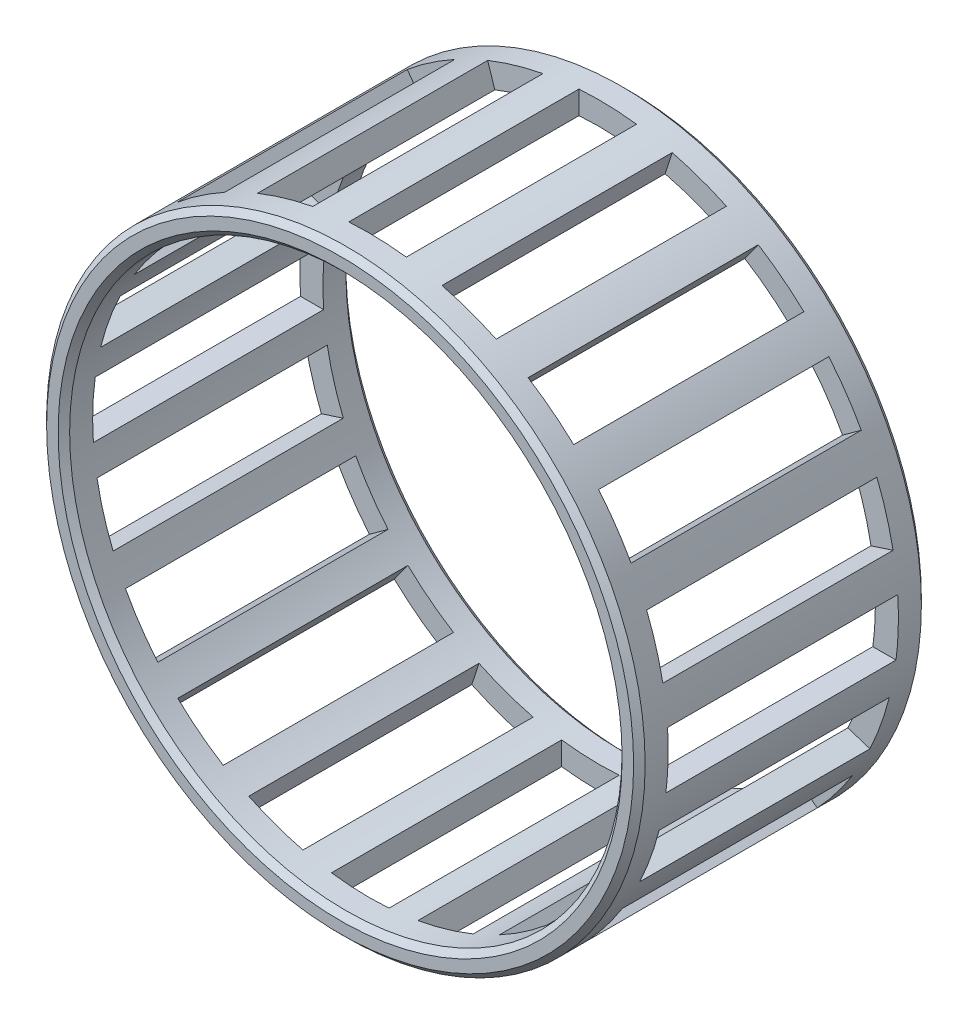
from build123d import *

# Parameters (mm, degrees)
ESQUISSE1_R                  = 26
ESQUISSE1_R_2                = 24
BASE_EXTRUSION_DEPTH         = 25
ENL_V_MAT_EXTRU_1_REACH      = 46.463
ENL_V_MAT_EXTRU_1_END_RADIUS = 26
ESQUISSE2_W                  = 5
ESQUISSE2_H                  = 20
R_P_TITION_CIRCULAIRE2_COUNT = 20
CHANFREIN1_SIZE              = 0.5


with BuildPart() as part:
    # Esquisse1 → Base-Extrusion (new body)
    with BuildSketch(Plane.XY):
        Circle(ESQUISSE1_R)
        Circle(ESQUISSE1_R_2, mode=Mode.SUBTRACT)
    extrude(amount=BASE_EXTRUSION_DEPTH)

    # Enl_v. mat.-Extru.1: up to this cylinder (the profile starts inside it)
    enl_v_mat_extru_1_end = Plane(origin=(0, 0, 12.5), z_dir=(0, 0, -1)) * Cylinder(ENL_V_MAT_EXTRU_1_END_RADIUS, 145.926, mode=Mode.PRIVATE)
    # Esquisse2 → Enl_v. mat.-Extru.1 (cut, up to the surface)
    with BuildSketch(Plane(origin=(0, 0, 0), x_dir=(1, 0, 0), z_dir=(0, 1, 0)), mode=Mode.PRIVATE) as enl_v_mat_extru_1_sk1:
        with Locations((-0.75, -12.5)):
            Rectangle(ESQUISSE2_W, ESQUISSE2_H)
    enl_v_mat_extru_1_tool1 = extrude(enl_v_mat_extru_1_sk1.sketch, amount=-ENL_V_MAT_EXTRU_1_REACH, mode=Mode.PRIVATE) & enl_v_mat_extru_1_end
    enl_v_mat_extru_1 = enl_v_mat_extru_1_tool1.solids().sort_by_distance((-0.75, 0, 12.5))[0]
    add(enl_v_mat_extru_1, mode=Mode.SUBTRACT)

    # R_p_tition circulaire2: Enl_v. mat.-Extru.1 ×20 about axis
    r_p_tition_circulaire2_axis = Axis((0, 0, 0), (0, 0, 1))
    for i in range(1, R_P_TITION_CIRCULAIRE2_COUNT):
        add(enl_v_mat_extru_1.rotate(r_p_tition_circulaire2_axis, i * 360 / R_P_TITION_CIRCULAIRE2_COUNT), mode=Mode.SUBTRACT)

    # Chanfrein1
    chanfrein1_edges = [part.edges().sort_by_distance(p)[0] for p in [
        (-26, 0, 0),
        (-26, 0, 25),
        (-24, 0, 0),
        (-24, 0, 25),
    ]]
    chamfer(chanfrein1_edges, length=CHANFREIN1_SIZE)


solid = part.part
